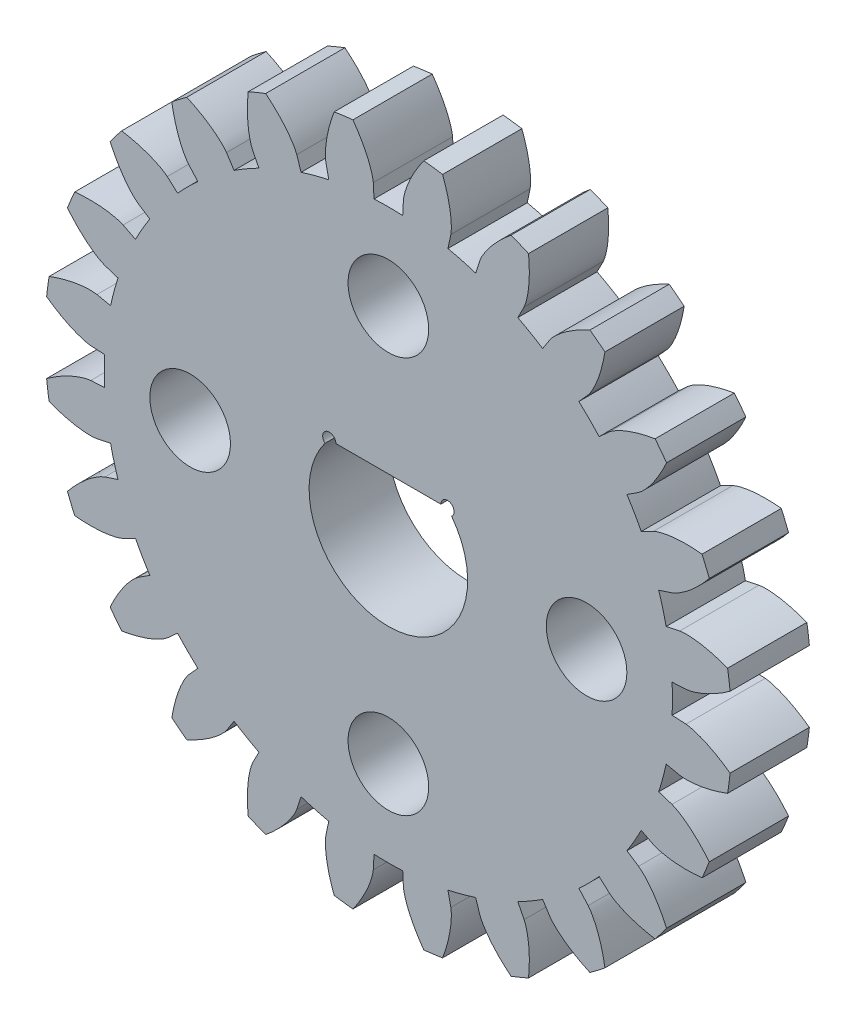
from build123d import *

# Parameters (mm, degrees)
EXTRUDE_1200_DEPTH          = 3
SKETCH_1285_R               = 37.176964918
SKETCH_1285_R_2             = 13
CUT_EXTRUDE_1626_DEPTH      = 39.958796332
CUT_EXTRUDE_2146_DEPTH      = 19.579565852
PATTERN_CIRCULAR_2249_COUNT = 24
SKETCH_2309_R               = 10.75
EXTRUDE_2632_DEPTH          = 3
CUT_EXTRUDE_D_DEPTH         = 19.53106928
SKETCH_1_R                  = 1.525
CUT_EXTRUDE_1_DEPTH         = 19.53106928


with BuildPart() as part:
    # Sketch 1018 → Extrude 1200 (new body)
    with BuildSketch(Plane.XY):
        with BuildLine():
            Line((-34.810597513, -13.051782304), (0.569734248, -11.261909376))
            Line((0.569734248, -11.261909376), (0, 0))
            Line((0, 0), (0, 10.73627013))
            Line((0, 10.73627013), (-0.543142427, 10.73627013))
            Line((-0.543142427, 10.73627013), (-0.569734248, 11.261909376))
            add(Edge.make_bspline(
                [(-0.569734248, 11.261909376), (-0.574039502, 11.304625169), (-0.58662303, 11.389421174), (-0.624880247, 11.548358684), (-0.699627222, 11.777149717), (-0.859532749, 12.161314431), (-1.181341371, 12.739542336), (-1.715210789, 13.454141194), (-2.596612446, 14.335278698), (-3.772336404, 15.202010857), (-5.187237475, 15.95872787), (-6.809569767, 16.555777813), (-8.492340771, 16.947544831), (-10.208004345, 17.146764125), (-12.020014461, 17.16644959), (-14.254309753, 16.95681711), (-16.868761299, 16.366827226), (-19.775097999, 15.244890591), (-22.771942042, 13.514750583), (-25.487635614, 11.372766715), (-27.888534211, 8.884747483), (-29.693862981, 6.45824407), (-31.021257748, 4.235120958), (-31.978360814, 2.303342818), (-32.653986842, 0.71630306), (-33.239321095, -0.905719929), (-33.734316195, -2.558294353), (-34.240622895, -4.652865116), (-34.597645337, -6.781899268), (-34.786628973, -8.711035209), (-34.848980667, -10.330102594), (-34.857641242, -11.185847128), (-34.853055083, -11.769522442), (-34.844894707, -12.225859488), (-34.828408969, -12.671101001), (-34.816961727, -12.925981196), (-34.810597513, -13.051782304)],
                knots=[0, 0, 0, 0, 0, 0.002802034, 0.005604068, 0.010661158, 0.015718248, 0.029959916, 0.048733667, 0.068727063, 0.096888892, 0.125050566, 0.153212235, 0.18137365, 0.209534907, 0.23769631, 0.271429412, 0.327752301, 0.384075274, 0.440398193, 0.496721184, 0.553044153, 0.609367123, 0.637528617, 0.665690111, 0.693851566, 0.72201302, 0.750174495, 0.77833597, 0.834658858, 0.862820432, 0.876901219, 0.883941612, 0.890982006, 0.90003647, 0.909090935, 0.909090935, 0.909090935, 0.909090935, 0.909090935], degree=4))
        make_face()
    extrude(amount=EXTRUDE_1200_DEPTH)

    # Mirror 1246: part across plane


with BuildPart() as part_1:
    add(part.part)
    add(part.part.mirror(Plane(origin=(0, 0, 3), x_dir=(0, 0, 1), z_dir=(1, 0, 0))))

    # Sketch 1285 → Cut-Extrude 1626 (cut, through all)
    with BuildSketch(Plane.XY.offset(3)):
        Circle(SKETCH_1285_R)
        Circle(SKETCH_1285_R_2, mode=Mode.SUBTRACT)
    extrude(amount=-CUT_EXTRUDE_1626_DEPTH, mode=Mode.SUBTRACT)

    # Sketch 1786 → Cut-Extrude 2146 (cut, through all)
    with BuildSketch(Plane.XY.offset(3)):
        with BuildLine():
            Line((-1.696840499, 12.888783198), (0, 0))
            Line((0, 0), (1.696840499, 12.888783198))
            ThreePointArc((1.696840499, 12.888783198), (0, -13), (-1.696840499, 12.888783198))
        make_face()
    extrude(amount=-CUT_EXTRUDE_2146_DEPTH, mode=Mode.SUBTRACT)


with BuildPart() as pattern_circular_2249_1:
    # Pattern Circular 2249: pattern copy
    add(part_1.part.rotate(Axis((0, 0, 0), (0, 0, 1)), 1 * 360 / PATTERN_CIRCULAR_2249_COUNT))


with BuildPart() as pattern_circular_2249_2:
    # Pattern Circular 2249: pattern copy
    add(part_1.part.rotate(Axis((0, 0, 0), (0, 0, 1)), 2 * 360 / PATTERN_CIRCULAR_2249_COUNT))


with BuildPart() as pattern_circular_2249_3:
    # Pattern Circular 2249: pattern copy
    add(part_1.part.rotate(Axis((0, 0, 0), (0, 0, 1)), 3 * 360 / PATTERN_CIRCULAR_2249_COUNT))


with BuildPart() as pattern_circular_2249_4:
    # Pattern Circular 2249: pattern copy
    add(part_1.part.rotate(Axis((0, 0, 0), (0, 0, 1)), 4 * 360 / PATTERN_CIRCULAR_2249_COUNT))


with BuildPart() as pattern_circular_2249_5:
    # Pattern Circular 2249: pattern copy
    add(part_1.part.rotate(Axis((0, 0, 0), (0, 0, 1)), 5 * 360 / PATTERN_CIRCULAR_2249_COUNT))


with BuildPart() as pattern_circular_2249_6:
    # Pattern Circular 2249: pattern copy
    add(part_1.part.rotate(Axis((0, 0, 0), (0, 0, 1)), 6 * 360 / PATTERN_CIRCULAR_2249_COUNT))


with BuildPart() as pattern_circular_2249_7:
    # Pattern Circular 2249: pattern copy
    add(part_1.part.rotate(Axis((0, 0, 0), (0, 0, 1)), 7 * 360 / PATTERN_CIRCULAR_2249_COUNT))


with BuildPart() as pattern_circular_2249_8:
    # Pattern Circular 2249: pattern copy
    add(part_1.part.rotate(Axis((0, 0, 0), (0, 0, 1)), 8 * 360 / PATTERN_CIRCULAR_2249_COUNT))


with BuildPart() as pattern_circular_2249_9:
    # Pattern Circular 2249: pattern copy
    add(part_1.part.rotate(Axis((0, 0, 0), (0, 0, 1)), 9 * 360 / PATTERN_CIRCULAR_2249_COUNT))


with BuildPart() as pattern_circular_2249_10:
    # Pattern Circular 2249: pattern copy
    add(part_1.part.rotate(Axis((0, 0, 0), (0, 0, 1)), 10 * 360 / PATTERN_CIRCULAR_2249_COUNT))


with BuildPart() as pattern_circular_2249_11:
    # Pattern Circular 2249: pattern copy
    add(part_1.part.rotate(Axis((0, 0, 0), (0, 0, 1)), 11 * 360 / PATTERN_CIRCULAR_2249_COUNT))


with BuildPart() as pattern_circular_2249_12:
    # Pattern Circular 2249: pattern copy
    add(part_1.part.rotate(Axis((0, 0, 0), (0, 0, 1)), 12 * 360 / PATTERN_CIRCULAR_2249_COUNT))


with BuildPart() as pattern_circular_2249_13:
    # Pattern Circular 2249: pattern copy
    add(part_1.part.rotate(Axis((0, 0, 0), (0, 0, 1)), 13 * 360 / PATTERN_CIRCULAR_2249_COUNT))


with BuildPart() as pattern_circular_2249_14:
    # Pattern Circular 2249: pattern copy
    add(part_1.part.rotate(Axis((0, 0, 0), (0, 0, 1)), 14 * 360 / PATTERN_CIRCULAR_2249_COUNT))


with BuildPart() as pattern_circular_2249_15:
    # Pattern Circular 2249: pattern copy
    add(part_1.part.rotate(Axis((0, 0, 0), (0, 0, 1)), 15 * 360 / PATTERN_CIRCULAR_2249_COUNT))


with BuildPart() as pattern_circular_2249_16:
    # Pattern Circular 2249: pattern copy
    add(part_1.part.rotate(Axis((0, 0, 0), (0, 0, 1)), 16 * 360 / PATTERN_CIRCULAR_2249_COUNT))


with BuildPart() as pattern_circular_2249_17:
    # Pattern Circular 2249: pattern copy
    add(part_1.part.rotate(Axis((0, 0, 0), (0, 0, 1)), 17 * 360 / PATTERN_CIRCULAR_2249_COUNT))


with BuildPart() as pattern_circular_2249_18:
    # Pattern Circular 2249: pattern copy
    add(part_1.part.rotate(Axis((0, 0, 0), (0, 0, 1)), 18 * 360 / PATTERN_CIRCULAR_2249_COUNT))


with BuildPart() as pattern_circular_2249_19:
    # Pattern Circular 2249: pattern copy
    add(part_1.part.rotate(Axis((0, 0, 0), (0, 0, 1)), 19 * 360 / PATTERN_CIRCULAR_2249_COUNT))


with BuildPart() as pattern_circular_2249_20:
    # Pattern Circular 2249: pattern copy
    add(part_1.part.rotate(Axis((0, 0, 0), (0, 0, 1)), 20 * 360 / PATTERN_CIRCULAR_2249_COUNT))


with BuildPart() as pattern_circular_2249_21:
    # Pattern Circular 2249: pattern copy
    add(part_1.part.rotate(Axis((0, 0, 0), (0, 0, 1)), 21 * 360 / PATTERN_CIRCULAR_2249_COUNT))


with BuildPart() as pattern_circular_2249_22:
    # Pattern Circular 2249: pattern copy
    add(part_1.part.rotate(Axis((0, 0, 0), (0, 0, 1)), 22 * 360 / PATTERN_CIRCULAR_2249_COUNT))


with BuildPart() as pattern_circular_2249_23:
    # Pattern Circular 2249: pattern copy
    add(part_1.part.rotate(Axis((0, 0, 0), (0, 0, 1)), 23 * 360 / PATTERN_CIRCULAR_2249_COUNT))


with BuildPart() as part_2:
    add(part_1.part)

    add(pattern_circular_2249_1.part)  # Extrude 2632 merges Pattern Circular 2249_1

    add(pattern_circular_2249_2.part)  # Extrude 2632 merges Pattern Circular 2249_2

    add(pattern_circular_2249_3.part)  # Extrude 2632 merges Pattern Circular 2249_3

    add(pattern_circular_2249_4.part)  # Extrude 2632 merges Pattern Circular 2249_4

    add(pattern_circular_2249_5.part)  # Extrude 2632 merges Pattern Circular 2249_5

    add(pattern_circular_2249_6.part)  # Extrude 2632 merges Pattern Circular 2249_6

    add(pattern_circular_2249_7.part)  # Extrude 2632 merges Pattern Circular 2249_7

    add(pattern_circular_2249_8.part)  # Extrude 2632 merges Pattern Circular 2249_8

    add(pattern_circular_2249_9.part)  # Extrude 2632 merges Pattern Circular 2249_9

    add(pattern_circular_2249_10.part)  # Extrude 2632 merges Pattern Circular 2249_10

    add(pattern_circular_2249_11.part)  # Extrude 2632 merges Pattern Circular 2249_11

    add(pattern_circular_2249_12.part)  # Extrude 2632 merges Pattern Circular 2249_12

    add(pattern_circular_2249_13.part)  # Extrude 2632 merges Pattern Circular 2249_13

    add(pattern_circular_2249_14.part)  # Extrude 2632 merges Pattern Circular 2249_14

    add(pattern_circular_2249_15.part)  # Extrude 2632 merges Pattern Circular 2249_15

    add(pattern_circular_2249_16.part)  # Extrude 2632 merges Pattern Circular 2249_16

    add(pattern_circular_2249_17.part)  # Extrude 2632 merges Pattern Circular 2249_17

    add(pattern_circular_2249_18.part)  # Extrude 2632 merges Pattern Circular 2249_18

    add(pattern_circular_2249_19.part)  # Extrude 2632 merges Pattern Circular 2249_19

    add(pattern_circular_2249_20.part)  # Extrude 2632 merges Pattern Circular 2249_20

    add(pattern_circular_2249_21.part)  # Extrude 2632 merges Pattern Circular 2249_21

    add(pattern_circular_2249_22.part)  # Extrude 2632 merges Pattern Circular 2249_22

    add(pattern_circular_2249_23.part)  # Extrude 2632 merges Pattern Circular 2249_23
    # Sketch 2309 → Extrude 2632 (add, through all)
    with BuildSketch(Plane.XY.offset(3)):
        Circle(SKETCH_2309_R)
    extrude(amount=-EXTRUDE_2632_DEPTH)

    # Sketch D → Cut-Extrude D (cut, through all)
    with BuildSketch(Plane.XY.offset(3)):
        with BuildLine():
            Line((-1.986067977, 2), (1.986067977, 2))
            ThreePointArc((1.986067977, 2), (2.342863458, 2.226041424), (2.39482578, 1.80687838))
            ThreePointArc((2.39482578, 1.80687838), (0, -3), (-2.39482578, 1.80687838))
            ThreePointArc((-2.39482578, 1.80687838), (-2.342863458, 2.226041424), (-1.986067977, 2))
        make_face()
    extrude(amount=-CUT_EXTRUDE_D_DEPTH, mode=Mode.SUBTRACT)

    # Sketch 1 → Cut-Extrude 1 (cut, through all)
    with BuildSketch(Plane.XY.offset(3)):
        with Locations((7.5, 0)):
            Circle(SKETCH_1_R)
        with Locations((0, -7.5)):
            Circle(SKETCH_1_R)
        with Locations((-7.5, 0)):
            Circle(SKETCH_1_R)
        with Locations((0, 7.5)):
            Circle(SKETCH_1_R)
    extrude(amount=-CUT_EXTRUDE_1_DEPTH, mode=Mode.SUBTRACT)


solid = part_2.part
